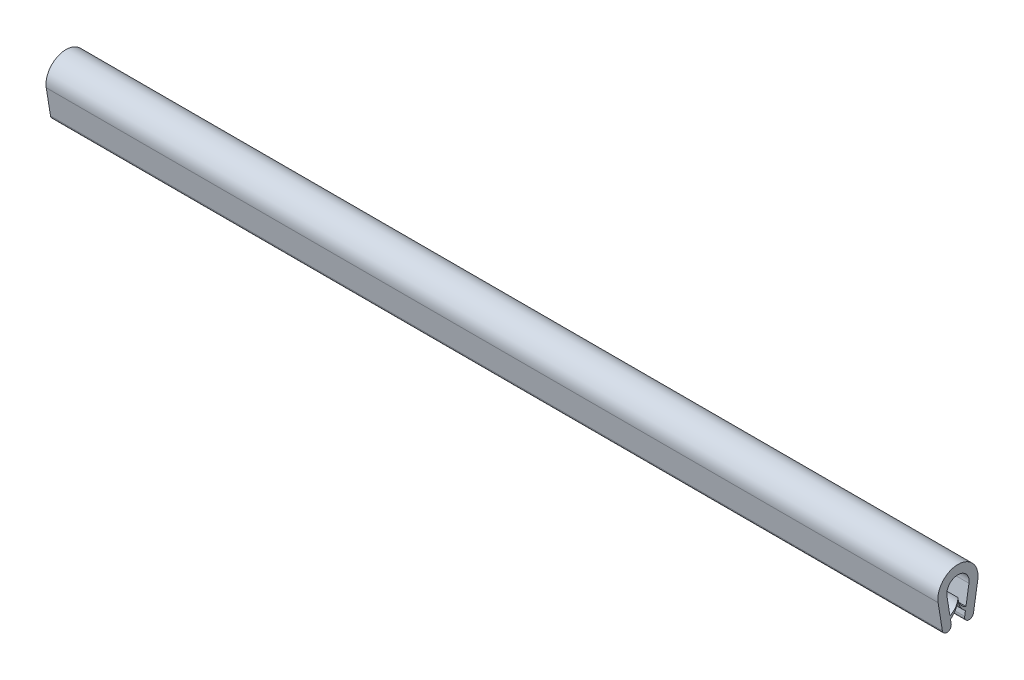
from build123d import *

# Parameters (mm, degrees)
REUNASUOJAT_1_6016_REUNASUOJA_1_0_3_0_1_DEPTH = 200


with BuildPart() as part:
    # Sketch1 → Reunasuojat 1.6016 REUNASUOJA 1_0-3_0_1 (new body)
    with BuildSketch(Plane(origin=(0, 0, 0), x_dir=(0, 0, -1), z_dir=(1, 0, 0))):
        with BuildLine():
            Line((-1.774887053, -4.775725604), (-1.941359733, -3.740188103))
            ThreePointArc((-1.941359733, -3.740188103), (-0.733718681, -2.354983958), (-0.262210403, -0.578789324))
            ThreePointArc((-0.262210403, -0.578789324), (0.209297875, -2.354983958), (1.416938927, -3.740188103))
            Line((1.416938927, -3.740188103), (1.250466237, -4.775725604))
            ThreePointArc((1.250466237, -4.775725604), (2.079067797, -5.921770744), (3.225112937, -5.093169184))
            Line((3.225112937, -5.093169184), (4.180744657, 0.851304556))
            ThreePointArc((4.180744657, 0.851304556), (0.452037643, 6.008507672), (-4.705165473, 2.279800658))
            ThreePointArc((-4.705165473, 2.279800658), (-4.762210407, 1.565552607), (-4.705165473, 0.851304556))
            Line((-4.705165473, 0.851304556), (-3.749533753, -5.093169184))
            ThreePointArc((-3.749533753, -5.093169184), (-2.603488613, -5.921770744), (-1.774887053, -4.775725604))
        make_face()
        with BuildLine():
            Line((-2.730518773, 1.168748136), (-2.058718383, -3.010162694))
            ThreePointArc((-2.058718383, -3.010162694), (-0.776094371, -1.956895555), (-0.262210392, -0.378789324))
            ThreePointArc((-0.262210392, -0.378789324), (0.25167358, -1.956895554), (1.534297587, -3.010162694))
            Line((1.534297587, -3.010162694), (2.206097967, 1.168748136))
            ThreePointArc((2.206097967, 1.168748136), (0.134594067, 4.033860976), (-2.730518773, 1.962357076))
            ThreePointArc((-2.730518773, 1.962357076), (-2.762210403, 1.565552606), (-2.730518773, 1.168748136))
        make_face(mode=Mode.SUBTRACT)
    extrude(amount=REUNASUOJAT_1_6016_REUNASUOJA_1_0_3_0_1_DEPTH)


solid = part.part
